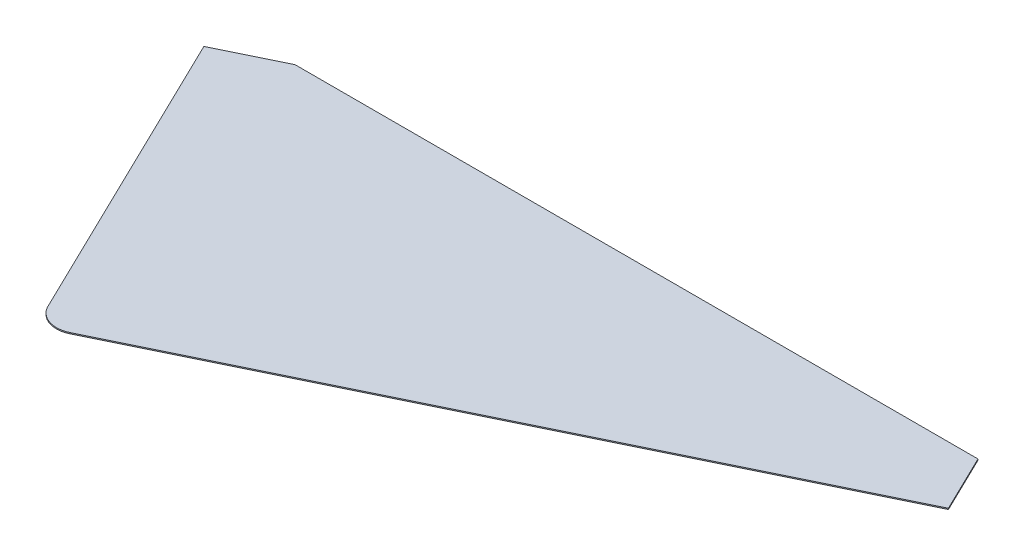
from build123d import *

# Parameters (mm, degrees)
BOSS_EXTRUDE1_DEPTH = 1


with BuildPart() as part:
    # Sketch2 → Boss-Extrude1 (new body)
    with BuildSketch(Plane(origin=(0, 0, 0), x_dir=(-1, 0, 0), z_dir=(0, 1, 0))):
        with BuildLine():
            Line((-320.161223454, 49.478447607), (-296.142830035, 0))
            Line((-296.142830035, 0), (291.963741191, 0))
            Line((291.963741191, 0), (344.824303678, 25.660178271))
            Line((344.824303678, 25.660178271), (218.181865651, 286.54653838))
            ThreePointArc((218.181865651, 286.54653838), (205.691826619, 297.638289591), (189.016982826, 296.649550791))
            Line((189.016982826, 296.649550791), (-320.161223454, 49.478447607))
        make_face()
    extrude(amount=BOSS_EXTRUDE1_DEPTH)


solid = part.part
